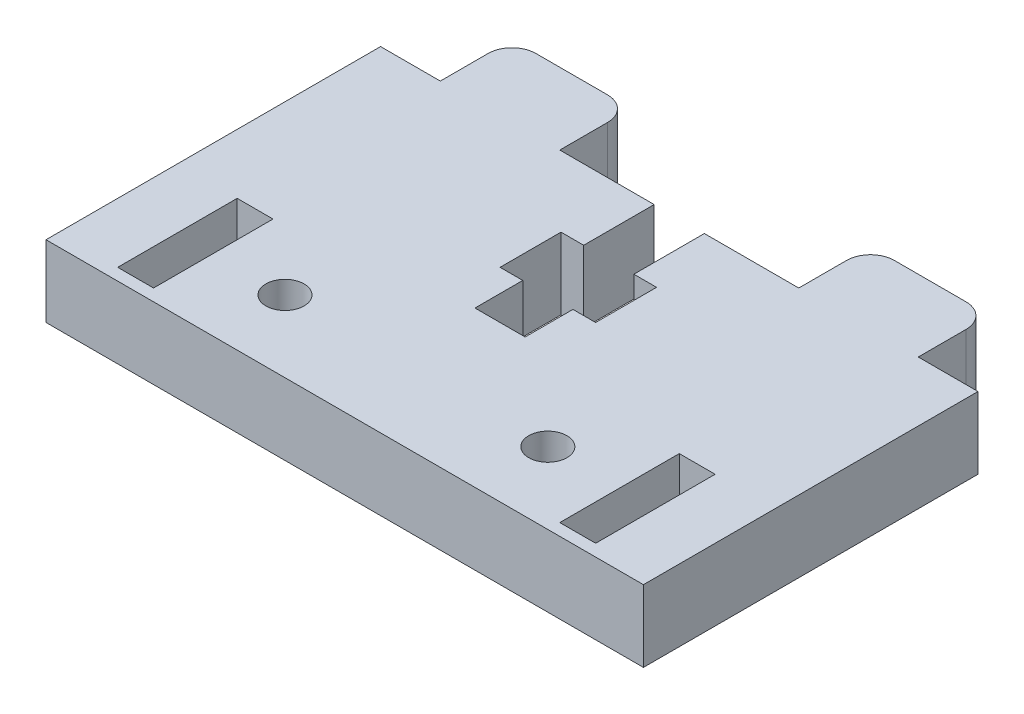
ISO-10303-21;
HEADER;
FILE_DESCRIPTION(('STEP AP214'),'2;1');
FILE_NAME('part.step','',(''),(''),'','','');
FILE_SCHEMA(('AUTOMOTIVE_DESIGN { 1 0 10303 214 1 1 1 1 }'));
ENDSEC;
DATA;
#1=APPLICATION_CONTEXT('core data for automotive mechanical design processes');
#2=APPLICATION_PROTOCOL_DEFINITION('international standard','automotive_design',2000,#1);
#3=PRODUCT_CONTEXT('',#1,'mechanical');
#4=PRODUCT('Part','Part','',(#3));
#5=PRODUCT_RELATED_PRODUCT_CATEGORY('part','',(#4));
#6=PRODUCT_DEFINITION_FORMATION('','',#4);
#7=PRODUCT_DEFINITION_CONTEXT('part definition',#1,'design');
#8=PRODUCT_DEFINITION('design','',#6,#7);
#9=PRODUCT_DEFINITION_SHAPE('','',#8);
#10=(LENGTH_UNIT() NAMED_UNIT(*) SI_UNIT(.MILLI.,.METRE.));
#11=(NAMED_UNIT(*) PLANE_ANGLE_UNIT() SI_UNIT($,.RADIAN.));
#12=(NAMED_UNIT(*) SI_UNIT($,.STERADIAN.) SOLID_ANGLE_UNIT());
#13=UNCERTAINTY_MEASURE_WITH_UNIT(LENGTH_MEASURE(1.E-05),#10,'distance_accuracy_value','');
#14=(GEOMETRIC_REPRESENTATION_CONTEXT(3) GLOBAL_UNCERTAINTY_ASSIGNED_CONTEXT((#13)) GLOBAL_UNIT_ASSIGNED_CONTEXT((#10,
#11,#12)) REPRESENTATION_CONTEXT('',''));
#15=CARTESIAN_POINT('',(0.,0.,0.));
#16=DIRECTION('',(0.,0.,1.));
#17=DIRECTION('',(1.,0.,0.));
#18=AXIS2_PLACEMENT_3D('',#15,#16,#17);
#19=CARTESIAN_POINT('',(45.,6.,0.));
#20=DIRECTION('',(1.,0.,0.));
#21=DIRECTION('',(0.,0.,-1.));
#22=AXIS2_PLACEMENT_3D('',#19,#20,#21);
#23=PLANE('',#22);
#24=DIRECTION('',(0.,0.,1.));
#25=VECTOR('',#24,1.);
#26=CARTESIAN_POINT('',(45.,0.,0.));
#27=LINE('',#26,#25);
#28=CARTESIAN_POINT('',(45.,0.,-11.));
#29=VERTEX_POINT('',#28);
#30=CARTESIAN_POINT('',(45.,0.,-1.));
#31=VERTEX_POINT('',#30);
#32=EDGE_CURVE('E333',#29,#31,#27,.T.);
#33=ORIENTED_EDGE('',*,*,#32,.T.);
#34=DIRECTION('',(0.,-1.,0.));
#35=VECTOR('',#34,1.);
#36=CARTESIAN_POINT('',(45.,6.,-1.));
#37=LINE('',#36,#35);
#38=CARTESIAN_POINT('',(45.,6.,-1.));
#39=VERTEX_POINT('',#38);
#40=EDGE_CURVE('E318',#39,#31,#37,.T.);
#41=ORIENTED_EDGE('',*,*,#40,.F.);
#42=DIRECTION('',(0.,0.,1.));
#43=VECTOR('',#42,1.);
#44=CARTESIAN_POINT('',(45.,6.,0.));
#45=LINE('',#44,#43);
#46=CARTESIAN_POINT('',(45.,6.,-11.));
#47=VERTEX_POINT('',#46);
#48=EDGE_CURVE('E413',#47,#39,#45,.T.);
#49=ORIENTED_EDGE('',*,*,#48,.F.);
#50=DIRECTION('',(0.,-1.,0.));
#51=VECTOR('',#50,1.);
#52=CARTESIAN_POINT('',(45.,6.,-11.));
#53=LINE('',#52,#51);
#54=EDGE_CURVE('E235',#47,#29,#53,.T.);
#55=ORIENTED_EDGE('',*,*,#54,.T.);
#56=EDGE_LOOP('',(#33,#41,#49,#55));
#57=FACE_BOUND('',#56,.T.);
#58=ADVANCED_FACE('F121',(#57),#23,.F.);
#59=CARTESIAN_POINT('',(0.,6.,-1.));
#60=DIRECTION('',(0.,0.,-1.));
#61=DIRECTION('',(-1.,0.,0.));
#62=AXIS2_PLACEMENT_3D('',#59,#60,#61);
#63=PLANE('',#62);
#64=DIRECTION('',(1.,0.,0.));
#65=VECTOR('',#64,1.);
#66=CARTESIAN_POINT('',(0.,0.,-1.));
#67=LINE('',#66,#65);
#68=CARTESIAN_POINT('',(42.,0.,-1.));
#69=VERTEX_POINT('',#68);
#70=EDGE_CURVE('E330',#69,#31,#67,.T.);
#71=ORIENTED_EDGE('',*,*,#70,.F.);
#72=DIRECTION('',(0.,-1.,0.));
#73=VECTOR('',#72,1.);
#74=CARTESIAN_POINT('',(42.,6.,-1.));
#75=LINE('',#74,#73);
#76=CARTESIAN_POINT('',(42.,6.,-1.));
#77=VERTEX_POINT('',#76);
#78=EDGE_CURVE('E321',#77,#69,#75,.T.);
#79=ORIENTED_EDGE('',*,*,#78,.F.);
#80=DIRECTION('',(1.,0.,0.));
#81=VECTOR('',#80,1.);
#82=CARTESIAN_POINT('',(0.,6.,-1.));
#83=LINE('',#82,#81);
#84=EDGE_CURVE('E410',#77,#39,#83,.T.);
#85=ORIENTED_EDGE('',*,*,#84,.T.);
#86=ORIENTED_EDGE('',*,*,#40,.T.);
#87=EDGE_LOOP('',(#71,#79,#85,#86));
#88=FACE_BOUND('',#87,.T.);
#89=ADVANCED_FACE('F737',(#88),#63,.T.);
#90=CARTESIAN_POINT('',(42.,6.,0.));
#91=DIRECTION('',(1.,0.,0.));
#92=DIRECTION('',(0.,0.,-1.));
#93=AXIS2_PLACEMENT_3D('',#90,#91,#92);
#94=PLANE('',#93);
#95=DIRECTION('',(0.,0.,1.));
#96=VECTOR('',#95,1.);
#97=CARTESIAN_POINT('',(42.,0.,0.));
#98=LINE('',#97,#96);
#99=CARTESIAN_POINT('',(42.,0.,-11.));
#100=VERTEX_POINT('',#99);
#101=EDGE_CURVE('E326',#100,#69,#98,.T.);
#102=ORIENTED_EDGE('',*,*,#101,.F.);
#103=DIRECTION('',(0.,-1.,0.));
#104=VECTOR('',#103,1.);
#105=CARTESIAN_POINT('',(42.,6.,-11.));
#106=LINE('',#105,#104);
#107=CARTESIAN_POINT('',(42.,6.,-11.));
#108=VERTEX_POINT('',#107);
#109=EDGE_CURVE('E307',#108,#100,#106,.T.);
#110=ORIENTED_EDGE('',*,*,#109,.F.);
#111=DIRECTION('',(0.,0.,1.));
#112=VECTOR('',#111,1.);
#113=CARTESIAN_POINT('',(42.,6.,0.));
#114=LINE('',#113,#112);
#115=EDGE_CURVE('E303',#108,#77,#114,.T.);
#116=ORIENTED_EDGE('',*,*,#115,.T.);
#117=ORIENTED_EDGE('',*,*,#78,.T.);
#118=EDGE_LOOP('',(#102,#110,#116,#117));
#119=FACE_BOUND('',#118,.T.);
#120=ADVANCED_FACE('F743',(#119),#94,.T.);
#121=CARTESIAN_POINT('',(0.,6.,-11.));
#122=DIRECTION('',(0.,0.,-1.));
#123=DIRECTION('',(-1.,0.,0.));
#124=AXIS2_PLACEMENT_3D('',#121,#122,#123);
#125=PLANE('',#124);
#126=DIRECTION('',(1.,0.,0.));
#127=VECTOR('',#126,1.);
#128=CARTESIAN_POINT('',(0.,0.,-11.));
#129=LINE('',#128,#127);
#130=EDGE_CURVE('E336',#100,#29,#129,.T.);
#131=ORIENTED_EDGE('',*,*,#130,.T.);
#132=ORIENTED_EDGE('',*,*,#54,.F.);
#133=DIRECTION('',(1.,0.,0.));
#134=VECTOR('',#133,1.);
#135=CARTESIAN_POINT('',(0.,6.,-11.));
#136=LINE('',#135,#134);
#137=EDGE_CURVE('E416',#108,#47,#136,.T.);
#138=ORIENTED_EDGE('',*,*,#137,.F.);
#139=ORIENTED_EDGE('',*,*,#109,.T.);
#140=EDGE_LOOP('',(#131,#132,#138,#139));
#141=FACE_BOUND('',#140,.T.);
#142=ADVANCED_FACE('F748',(#141),#125,.F.);
#143=CARTESIAN_POINT('',(8.,6.,0.));
#144=DIRECTION('',(1.,0.,0.));
#145=DIRECTION('',(0.,0.,-1.));
#146=AXIS2_PLACEMENT_3D('',#143,#144,#145);
#147=PLANE('',#146);
#148=DIRECTION('',(0.,0.,1.));
#149=VECTOR('',#148,1.);
#150=CARTESIAN_POINT('',(8.,0.,0.));
#151=LINE('',#150,#149);
#152=CARTESIAN_POINT('',(8.,0.,-11.));
#153=VERTEX_POINT('',#152);
#154=CARTESIAN_POINT('',(8.,0.,-1.));
#155=VERTEX_POINT('',#154);
#156=EDGE_CURVE('E345',#153,#155,#151,.T.);
#157=ORIENTED_EDGE('',*,*,#156,.T.);
#158=DIRECTION('',(0.,-1.,0.));
#159=VECTOR('',#158,1.);
#160=CARTESIAN_POINT('',(8.,6.,-1.));
#161=LINE('',#160,#159);
#162=CARTESIAN_POINT('',(8.,6.,-1.));
#163=VERTEX_POINT('',#162);
#164=EDGE_CURVE('E308',#163,#155,#161,.T.);
#165=ORIENTED_EDGE('',*,*,#164,.F.);
#166=DIRECTION('',(0.,0.,1.));
#167=VECTOR('',#166,1.);
#168=CARTESIAN_POINT('',(8.,6.,0.));
#169=LINE('',#168,#167);
#170=CARTESIAN_POINT('',(8.,6.,-11.));
#171=VERTEX_POINT('',#170);
#172=EDGE_CURVE('E425',#171,#163,#169,.T.);
#173=ORIENTED_EDGE('',*,*,#172,.F.);
#174=DIRECTION('',(0.,-1.,0.));
#175=VECTOR('',#174,1.);
#176=CARTESIAN_POINT('',(8.,6.,-11.));
#177=LINE('',#176,#175);
#178=EDGE_CURVE('E304',#171,#153,#177,.T.);
#179=ORIENTED_EDGE('',*,*,#178,.T.);
#180=EDGE_LOOP('',(#157,#165,#173,#179));
#181=FACE_BOUND('',#180,.T.);
#182=ADVANCED_FACE('F751',(#181),#147,.F.);
#183=CARTESIAN_POINT('',(0.,6.,-0.999999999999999));
#184=DIRECTION('',(0.,0.,-1.));
#185=DIRECTION('',(-1.,0.,0.));
#186=AXIS2_PLACEMENT_3D('',#183,#184,#185);
#187=PLANE('',#186);
#188=DIRECTION('',(1.,0.,0.));
#189=VECTOR('',#188,1.);
#190=CARTESIAN_POINT('',(0.,0.,-0.999999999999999));
#191=LINE('',#190,#189);
#192=CARTESIAN_POINT('',(5.,0.,-1.));
#193=VERTEX_POINT('',#192);
#194=EDGE_CURVE('E342',#193,#155,#191,.T.);
#195=ORIENTED_EDGE('',*,*,#194,.F.);
#196=DIRECTION('',(0.,-1.,0.));
#197=VECTOR('',#196,1.);
#198=CARTESIAN_POINT('',(5.,6.,-1.));
#199=LINE('',#198,#197);
#200=CARTESIAN_POINT('',(5.,6.,-1.));
#201=VERTEX_POINT('',#200);
#202=EDGE_CURVE('E311',#201,#193,#199,.T.);
#203=ORIENTED_EDGE('',*,*,#202,.F.);
#204=DIRECTION('',(1.,0.,0.));
#205=VECTOR('',#204,1.);
#206=CARTESIAN_POINT('',(0.,6.,-0.999999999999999));
#207=LINE('',#206,#205);
#208=EDGE_CURVE('E422',#201,#163,#207,.T.);
#209=ORIENTED_EDGE('',*,*,#208,.T.);
#210=ORIENTED_EDGE('',*,*,#164,.T.);
#211=EDGE_LOOP('',(#195,#203,#209,#210));
#212=FACE_BOUND('',#211,.T.);
#213=ADVANCED_FACE('F757',(#212),#187,.T.);
#214=CARTESIAN_POINT('',(5.,6.,0.));
#215=DIRECTION('',(1.,0.,0.));
#216=DIRECTION('',(0.,0.,-1.));
#217=AXIS2_PLACEMENT_3D('',#214,#215,#216);
#218=PLANE('',#217);
#219=DIRECTION('',(0.,0.,1.));
#220=VECTOR('',#219,1.);
#221=CARTESIAN_POINT('',(5.,0.,0.));
#222=LINE('',#221,#220);
#223=CARTESIAN_POINT('',(5.00000000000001,0.,-11.));
#224=VERTEX_POINT('',#223);
#225=EDGE_CURVE('E339',#224,#193,#222,.T.);
#226=ORIENTED_EDGE('',*,*,#225,.F.);
#227=DIRECTION('',(0.,-1.,0.));
#228=VECTOR('',#227,1.);
#229=CARTESIAN_POINT('',(5.00000000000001,6.,-11.));
#230=LINE('',#229,#228);
#231=CARTESIAN_POINT('',(5.00000000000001,6.,-11.));
#232=VERTEX_POINT('',#231);
#233=EDGE_CURVE('E239',#232,#224,#230,.T.);
#234=ORIENTED_EDGE('',*,*,#233,.F.);
#235=DIRECTION('',(0.,0.,1.));
#236=VECTOR('',#235,1.);
#237=CARTESIAN_POINT('',(5.,6.,0.));
#238=LINE('',#237,#236);
#239=EDGE_CURVE('E419',#232,#201,#238,.T.);
#240=ORIENTED_EDGE('',*,*,#239,.T.);
#241=ORIENTED_EDGE('',*,*,#202,.T.);
#242=EDGE_LOOP('',(#226,#234,#240,#241));
#243=FACE_BOUND('',#242,.T.);
#244=ADVANCED_FACE('F753',(#243),#218,.T.);
#245=CARTESIAN_POINT('',(0.,6.,-11.));
#246=DIRECTION('',(0.,0.,-1.));
#247=DIRECTION('',(-1.,0.,0.));
#248=AXIS2_PLACEMENT_3D('',#245,#246,#247);
#249=PLANE('',#248);
#250=DIRECTION('',(1.,0.,0.));
#251=VECTOR('',#250,1.);
#252=CARTESIAN_POINT('',(0.,0.,-11.));
#253=LINE('',#252,#251);
#254=EDGE_CURVE('E348',#224,#153,#253,.T.);
#255=ORIENTED_EDGE('',*,*,#254,.T.);
#256=ORIENTED_EDGE('',*,*,#178,.F.);
#257=DIRECTION('',(1.,0.,0.));
#258=VECTOR('',#257,1.);
#259=CARTESIAN_POINT('',(0.,6.,-11.));
#260=LINE('',#259,#258);
#261=EDGE_CURVE('E428',#232,#171,#260,.T.);
#262=ORIENTED_EDGE('',*,*,#261,.F.);
#263=ORIENTED_EDGE('',*,*,#233,.T.);
#264=EDGE_LOOP('',(#255,#256,#262,#263));
#265=FACE_BOUND('',#264,.T.);
#266=ADVANCED_FACE('F756',(#265),#249,.F.);
#267=CARTESIAN_POINT('',(14.,6.,-6.));
#268=DIRECTION('',(0.,-1.,0.));
#269=DIRECTION('',(0.,0.,-1.));
#270=AXIS2_PLACEMENT_3D('',#267,#268,#269);
#271=CYLINDRICAL_SURFACE('',#270,1.6);
#272=CARTESIAN_POINT('',(14.,6.,-6.));
#273=DIRECTION('',(0.,1.,0.));
#274=DIRECTION('',(0.,0.,1.));
#275=AXIS2_PLACEMENT_3D('',#272,#273,#274);
#276=CIRCLE('',#275,1.6);
#277=CARTESIAN_POINT('',(14.,6.,-4.4));
#278=VERTEX_POINT('',#277);
#279=EDGE_CURVE('E431',#278,#278,#276,.T.);
#280=ORIENTED_EDGE('',*,*,#279,.T.);
#281=EDGE_LOOP('',(#280));
#282=FACE_BOUND('',#281,.T.);
#283=CARTESIAN_POINT('',(14.,0.,-6.));
#284=DIRECTION('',(0.,1.,0.));
#285=DIRECTION('',(0.,0.,1.));
#286=AXIS2_PLACEMENT_3D('',#283,#284,#285);
#287=CIRCLE('',#286,1.6);
#288=CARTESIAN_POINT('',(14.,0.,-4.4));
#289=VERTEX_POINT('',#288);
#290=EDGE_CURVE('E351',#289,#289,#287,.T.);
#291=ORIENTED_EDGE('',*,*,#290,.F.);
#292=EDGE_LOOP('',(#291));
#293=FACE_BOUND('',#292,.T.);
#294=ADVANCED_FACE('F767',(#282,#293),#271,.F.);
#295=CARTESIAN_POINT('',(36.,6.,-6.));
#296=DIRECTION('',(0.,-1.,0.));
#297=DIRECTION('',(0.,0.,-1.));
#298=AXIS2_PLACEMENT_3D('',#295,#296,#297);
#299=CYLINDRICAL_SURFACE('',#298,1.6);
#300=CARTESIAN_POINT('',(36.,6.,-6.));
#301=DIRECTION('',(0.,1.,0.));
#302=DIRECTION('',(0.,0.,1.));
#303=AXIS2_PLACEMENT_3D('',#300,#301,#302);
#304=CIRCLE('',#303,1.6);
#305=CARTESIAN_POINT('',(36.,6.,-4.4));
#306=VERTEX_POINT('',#305);
#307=EDGE_CURVE('E434',#306,#306,#304,.T.);
#308=ORIENTED_EDGE('',*,*,#307,.T.);
#309=EDGE_LOOP('',(#308));
#310=FACE_BOUND('',#309,.T.);
#311=CARTESIAN_POINT('',(36.,0.,-6.));
#312=DIRECTION('',(0.,1.,0.));
#313=DIRECTION('',(0.,0.,1.));
#314=AXIS2_PLACEMENT_3D('',#311,#312,#313);
#315=CIRCLE('',#314,1.6);
#316=CARTESIAN_POINT('',(36.,0.,-4.4));
#317=VERTEX_POINT('',#316);
#318=EDGE_CURVE('E354',#317,#317,#315,.T.);
#319=ORIENTED_EDGE('',*,*,#318,.F.);
#320=EDGE_LOOP('',(#319));
#321=FACE_BOUND('',#320,.T.);
#322=ADVANCED_FACE('F771',(#310,#321),#299,.F.);
#323=CARTESIAN_POINT('',(35.,6.,0.));
#324=DIRECTION('',(-1.,0.,0.));
#325=DIRECTION('',(0.,0.,1.));
#326=AXIS2_PLACEMENT_3D('',#323,#324,#325);
#327=PLANE('',#326);
#328=DIRECTION('',(0.,0.,-1.));
#329=VECTOR('',#328,1.);
#330=CARTESIAN_POINT('',(35.,0.,0.));
#331=LINE('',#330,#329);
#332=CARTESIAN_POINT('',(35.,0.,-28.));
#333=VERTEX_POINT('',#332);
#334=CARTESIAN_POINT('',(35.,0.,-32.));
#335=VERTEX_POINT('',#334);
#336=EDGE_CURVE('E403',#333,#335,#331,.T.);
#337=ORIENTED_EDGE('',*,*,#336,.F.);
#338=DIRECTION('',(0.,-1.,0.));
#339=VECTOR('',#338,1.);
#340=CARTESIAN_POINT('',(35.,6.,-28.));
#341=LINE('',#340,#339);
#342=CARTESIAN_POINT('',(35.,6.,-28.));
#343=VERTEX_POINT('',#342);
#344=EDGE_CURVE('E240',#343,#333,#341,.T.);
#345=ORIENTED_EDGE('',*,*,#344,.F.);
#346=DIRECTION('',(0.,0.,-1.));
#347=VECTOR('',#346,1.);
#348=CARTESIAN_POINT('',(35.,6.,0.));
#349=LINE('',#348,#347);
#350=CARTESIAN_POINT('',(35.,6.,-32.));
#351=VERTEX_POINT('',#350);
#352=EDGE_CURVE('E485',#343,#351,#349,.T.);
#353=ORIENTED_EDGE('',*,*,#352,.T.);
#354=DIRECTION('',(0.,-1.,0.));
#355=VECTOR('',#354,1.);
#356=CARTESIAN_POINT('',(35.,6.,-32.));
#357=LINE('',#356,#355);
#358=EDGE_CURVE('E236',#351,#335,#357,.T.);
#359=ORIENTED_EDGE('',*,*,#358,.T.);
#360=EDGE_LOOP('',(#337,#345,#353,#359));
#361=FACE_BOUND('',#360,.T.);
#362=ADVANCED_FACE('F662',(#361),#327,.T.);
#363=CARTESIAN_POINT('',(0.,6.,-28.));
#364=DIRECTION('',(0.,0.,-1.));
#365=DIRECTION('',(-1.,0.,0.));
#366=AXIS2_PLACEMENT_3D('',#363,#364,#365);
#367=PLANE('',#366);
#368=DIRECTION('',(1.,0.,0.));
#369=VECTOR('',#368,1.);
#370=CARTESIAN_POINT('',(0.,0.,-28.));
#371=LINE('',#370,#369);
#372=CARTESIAN_POINT('',(27.1,0.,-28.));
#373=VERTEX_POINT('',#372);
#374=EDGE_CURVE('E400',#373,#333,#371,.T.);
#375=ORIENTED_EDGE('',*,*,#374,.F.);
#376=DIRECTION('',(0.,-1.,0.));
#377=VECTOR('',#376,1.);
#378=CARTESIAN_POINT('',(27.1,6.,-28.));
#379=LINE('',#378,#377);
#380=CARTESIAN_POINT('',(27.1,6.,-28.));
#381=VERTEX_POINT('',#380);
#382=EDGE_CURVE('E243',#381,#373,#379,.T.);
#383=ORIENTED_EDGE('',*,*,#382,.F.);
#384=DIRECTION('',(1.,0.,0.));
#385=VECTOR('',#384,1.);
#386=CARTESIAN_POINT('',(0.,6.,-28.));
#387=LINE('',#386,#385);
#388=EDGE_CURVE('E482',#381,#343,#387,.T.);
#389=ORIENTED_EDGE('',*,*,#388,.T.);
#390=ORIENTED_EDGE('',*,*,#344,.T.);
#391=EDGE_LOOP('',(#375,#383,#389,#390));
#392=FACE_BOUND('',#391,.T.);
#393=ADVANCED_FACE('F666',(#392),#367,.T.);
#394=CARTESIAN_POINT('',(27.1,6.,0.));
#395=DIRECTION('',(1.,0.,0.));
#396=DIRECTION('',(0.,0.,-1.));
#397=AXIS2_PLACEMENT_3D('',#394,#395,#396);
#398=PLANE('',#397);
#399=DIRECTION('',(0.,0.,1.));
#400=VECTOR('',#399,1.);
#401=CARTESIAN_POINT('',(27.1,0.,0.));
#402=LINE('',#401,#400);
#403=CARTESIAN_POINT('',(27.1,0.,-22.1));
#404=VERTEX_POINT('',#403);
#405=EDGE_CURVE('E397',#373,#404,#402,.T.);
#406=ORIENTED_EDGE('',*,*,#405,.T.);
#407=DIRECTION('',(0.,-1.,0.));
#408=VECTOR('',#407,1.);
#409=CARTESIAN_POINT('',(27.1,6.,-22.1));
#410=LINE('',#409,#408);
#411=CARTESIAN_POINT('',(27.1,6.,-22.1));
#412=VERTEX_POINT('',#411);
#413=EDGE_CURVE('E246',#412,#404,#410,.T.);
#414=ORIENTED_EDGE('',*,*,#413,.F.);
#415=DIRECTION('',(0.,0.,1.));
#416=VECTOR('',#415,1.);
#417=CARTESIAN_POINT('',(27.1,6.,0.));
#418=LINE('',#417,#416);
#419=EDGE_CURVE('E479',#381,#412,#418,.T.);
#420=ORIENTED_EDGE('',*,*,#419,.F.);
#421=ORIENTED_EDGE('',*,*,#382,.T.);
#422=EDGE_LOOP('',(#406,#414,#420,#421));
#423=FACE_BOUND('',#422,.T.);
#424=ADVANCED_FACE('F671',(#423),#398,.F.);
#425=CARTESIAN_POINT('',(0.,6.,-22.1));
#426=DIRECTION('',(0.,0.,-1.));
#427=DIRECTION('',(-1.,0.,0.));
#428=AXIS2_PLACEMENT_3D('',#425,#426,#427);
#429=PLANE('',#428);
#430=DIRECTION('',(1.,0.,0.));
#431=VECTOR('',#430,1.);
#432=CARTESIAN_POINT('',(0.,0.,-22.1));
#433=LINE('',#432,#431);
#434=CARTESIAN_POINT('',(29.,0.,-22.1));
#435=VERTEX_POINT('',#434);
#436=EDGE_CURVE('E394',#404,#435,#433,.T.);
#437=ORIENTED_EDGE('',*,*,#436,.T.);
#438=DIRECTION('',(0.,-1.,0.));
#439=VECTOR('',#438,1.);
#440=CARTESIAN_POINT('',(29.,6.,-22.1));
#441=LINE('',#440,#439);
#442=CARTESIAN_POINT('',(29.,6.,-22.1));
#443=VERTEX_POINT('',#442);
#444=EDGE_CURVE('E249',#443,#435,#441,.T.);
#445=ORIENTED_EDGE('',*,*,#444,.F.);
#446=DIRECTION('',(1.,0.,0.));
#447=VECTOR('',#446,1.);
#448=CARTESIAN_POINT('',(0.,6.,-22.1));
#449=LINE('',#448,#447);
#450=EDGE_CURVE('E476',#412,#443,#449,.T.);
#451=ORIENTED_EDGE('',*,*,#450,.F.);
#452=ORIENTED_EDGE('',*,*,#413,.T.);
#453=EDGE_LOOP('',(#437,#445,#451,#452));
#454=FACE_BOUND('',#453,.T.);
#455=ADVANCED_FACE('F678',(#454),#429,.F.);
#456=CARTESIAN_POINT('',(29.,6.,0.));
#457=DIRECTION('',(1.,0.,0.));
#458=DIRECTION('',(0.,0.,-1.));
#459=AXIS2_PLACEMENT_3D('',#456,#457,#458);
#460=PLANE('',#459);
#461=DIRECTION('',(0.,0.,1.));
#462=VECTOR('',#461,1.);
#463=CARTESIAN_POINT('',(29.,0.,0.));
#464=LINE('',#463,#462);
#465=CARTESIAN_POINT('',(29.,0.,-17.));
#466=VERTEX_POINT('',#465);
#467=EDGE_CURVE('E391',#435,#466,#464,.T.);
#468=ORIENTED_EDGE('',*,*,#467,.T.);
#469=DIRECTION('',(0.,-1.,0.));
#470=VECTOR('',#469,1.);
#471=CARTESIAN_POINT('',(29.,6.,-17.));
#472=LINE('',#471,#470);
#473=CARTESIAN_POINT('',(29.,6.,-17.));
#474=VERTEX_POINT('',#473);
#475=EDGE_CURVE('E252',#474,#466,#472,.T.);
#476=ORIENTED_EDGE('',*,*,#475,.F.);
#477=DIRECTION('',(0.,0.,1.));
#478=VECTOR('',#477,1.);
#479=CARTESIAN_POINT('',(29.,6.,0.));
#480=LINE('',#479,#478);
#481=EDGE_CURVE('E473',#443,#474,#480,.T.);
#482=ORIENTED_EDGE('',*,*,#481,.F.);
#483=ORIENTED_EDGE('',*,*,#444,.T.);
#484=EDGE_LOOP('',(#468,#476,#482,#483));
#485=FACE_BOUND('',#484,.T.);
#486=ADVANCED_FACE('F682',(#485),#460,.F.);
#487=CARTESIAN_POINT('',(0.,6.,-17.));
#488=DIRECTION('',(0.,0.,-1.));
#489=DIRECTION('',(-1.,0.,0.));
#490=AXIS2_PLACEMENT_3D('',#487,#488,#489);
#491=PLANE('',#490);
#492=DIRECTION('',(1.,0.,0.));
#493=VECTOR('',#492,1.);
#494=CARTESIAN_POINT('',(0.,0.,-17.));
#495=LINE('',#494,#493);
#496=CARTESIAN_POINT('',(27.1,0.,-17.));
#497=VERTEX_POINT('',#496);
#498=EDGE_CURVE('E388',#497,#466,#495,.T.);
#499=ORIENTED_EDGE('',*,*,#498,.F.);
#500=DIRECTION('',(0.,-1.,0.));
#501=VECTOR('',#500,1.);
#502=CARTESIAN_POINT('',(27.1,6.,-17.));
#503=LINE('',#502,#501);
#504=CARTESIAN_POINT('',(27.1,6.,-17.));
#505=VERTEX_POINT('',#504);
#506=EDGE_CURVE('E255',#505,#497,#503,.T.);
#507=ORIENTED_EDGE('',*,*,#506,.F.);
#508=DIRECTION('',(1.,0.,0.));
#509=VECTOR('',#508,1.);
#510=CARTESIAN_POINT('',(0.,6.,-17.));
#511=LINE('',#510,#509);
#512=EDGE_CURVE('E470',#505,#474,#511,.T.);
#513=ORIENTED_EDGE('',*,*,#512,.T.);
#514=ORIENTED_EDGE('',*,*,#475,.T.);
#515=EDGE_LOOP('',(#499,#507,#513,#514));
#516=FACE_BOUND('',#515,.T.);
#517=ADVANCED_FACE('F685',(#516),#491,.T.);
#518=CARTESIAN_POINT('',(27.1,0.,-13.));
#519=VERTEX_POINT('',#518);
#520=EDGE_CURVE('E387',#497,#519,#402,.T.);
#521=ORIENTED_EDGE('',*,*,#520,.T.);
#522=DIRECTION('',(0.,-1.,0.));
#523=VECTOR('',#522,1.);
#524=CARTESIAN_POINT('',(27.1,6.,-13.));
#525=LINE('',#524,#523);
#526=CARTESIAN_POINT('',(27.1,6.,-13.));
#527=VERTEX_POINT('',#526);
#528=EDGE_CURVE('E258',#527,#519,#525,.T.);
#529=ORIENTED_EDGE('',*,*,#528,.F.);
#530=EDGE_CURVE('E469',#505,#527,#418,.T.);
#531=ORIENTED_EDGE('',*,*,#530,.F.);
#532=ORIENTED_EDGE('',*,*,#506,.T.);
#533=EDGE_LOOP('',(#521,#529,#531,#532));
#534=FACE_BOUND('',#533,.T.);
#535=ADVANCED_FACE('F692',(#534),#398,.F.);
#536=CARTESIAN_POINT('',(0.,6.,-13.));
#537=DIRECTION('',(0.,0.,-1.));
#538=DIRECTION('',(-1.,0.,0.));
#539=AXIS2_PLACEMENT_3D('',#536,#537,#538);
#540=PLANE('',#539);
#541=DIRECTION('',(1.,0.,0.));
#542=VECTOR('',#541,1.);
#543=CARTESIAN_POINT('',(0.,0.,-13.));
#544=LINE('',#543,#542);
#545=CARTESIAN_POINT('',(22.9,0.,-13.));
#546=VERTEX_POINT('',#545);
#547=EDGE_CURVE('E383',#546,#519,#544,.T.);
#548=ORIENTED_EDGE('',*,*,#547,.F.);
#549=DIRECTION('',(0.,-1.,0.));
#550=VECTOR('',#549,1.);
#551=CARTESIAN_POINT('',(22.9,6.,-13.));
#552=LINE('',#551,#550);
#553=CARTESIAN_POINT('',(22.9,6.,-13.));
#554=VERTEX_POINT('',#553);
#555=EDGE_CURVE('E261',#554,#546,#552,.T.);
#556=ORIENTED_EDGE('',*,*,#555,.F.);
#557=DIRECTION('',(1.,0.,0.));
#558=VECTOR('',#557,1.);
#559=CARTESIAN_POINT('',(0.,6.,-13.));
#560=LINE('',#559,#558);
#561=EDGE_CURVE('E465',#554,#527,#560,.T.);
#562=ORIENTED_EDGE('',*,*,#561,.T.);
#563=ORIENTED_EDGE('',*,*,#528,.T.);
#564=EDGE_LOOP('',(#548,#556,#562,#563));
#565=FACE_BOUND('',#564,.T.);
#566=ADVANCED_FACE('F696',(#565),#540,.T.);
#567=CARTESIAN_POINT('',(22.9,6.,0.));
#568=DIRECTION('',(1.,0.,0.));
#569=DIRECTION('',(0.,0.,-1.));
#570=AXIS2_PLACEMENT_3D('',#567,#568,#569);
#571=PLANE('',#570);
#572=DIRECTION('',(0.,0.,1.));
#573=VECTOR('',#572,1.);
#574=CARTESIAN_POINT('',(22.9,0.,0.));
#575=LINE('',#574,#573);
#576=CARTESIAN_POINT('',(22.9,0.,-17.));
#577=VERTEX_POINT('',#576);
#578=EDGE_CURVE('E380',#577,#546,#575,.T.);
#579=ORIENTED_EDGE('',*,*,#578,.F.);
#580=DIRECTION('',(0.,-1.,0.));
#581=VECTOR('',#580,1.);
#582=CARTESIAN_POINT('',(22.9,6.,-17.));
#583=LINE('',#582,#581);
#584=CARTESIAN_POINT('',(22.9,6.,-17.));
#585=VERTEX_POINT('',#584);
#586=EDGE_CURVE('E264',#585,#577,#583,.T.);
#587=ORIENTED_EDGE('',*,*,#586,.F.);
#588=DIRECTION('',(0.,0.,1.));
#589=VECTOR('',#588,1.);
#590=CARTESIAN_POINT('',(22.9,6.,0.));
#591=LINE('',#590,#589);
#592=EDGE_CURVE('E462',#585,#554,#591,.T.);
#593=ORIENTED_EDGE('',*,*,#592,.T.);
#594=ORIENTED_EDGE('',*,*,#555,.T.);
#595=EDGE_LOOP('',(#579,#587,#593,#594));
#596=FACE_BOUND('',#595,.T.);
#597=ADVANCED_FACE('F699',(#596),#571,.T.);
#598=CARTESIAN_POINT('',(21.,0.,-17.));
#599=VERTEX_POINT('',#598);
#600=EDGE_CURVE('E379',#599,#577,#495,.T.);
#601=ORIENTED_EDGE('',*,*,#600,.F.);
#602=DIRECTION('',(0.,-1.,0.));
#603=VECTOR('',#602,1.);
#604=CARTESIAN_POINT('',(21.,6.,-17.));
#605=LINE('',#604,#603);
#606=CARTESIAN_POINT('',(21.,6.,-17.));
#607=VERTEX_POINT('',#606);
#608=EDGE_CURVE('E267',#607,#599,#605,.T.);
#609=ORIENTED_EDGE('',*,*,#608,.F.);
#610=EDGE_CURVE('E461',#607,#585,#511,.T.);
#611=ORIENTED_EDGE('',*,*,#610,.T.);
#612=ORIENTED_EDGE('',*,*,#586,.T.);
#613=EDGE_LOOP('',(#601,#609,#611,#612));
#614=FACE_BOUND('',#613,.T.);
#615=ADVANCED_FACE('F706',(#614),#491,.T.);
#616=CARTESIAN_POINT('',(21.,6.,0.));
#617=DIRECTION('',(1.,0.,0.));
#618=DIRECTION('',(0.,0.,-1.));
#619=AXIS2_PLACEMENT_3D('',#616,#617,#618);
#620=PLANE('',#619);
#621=DIRECTION('',(0.,0.,1.));
#622=VECTOR('',#621,1.);
#623=CARTESIAN_POINT('',(21.,0.,0.));
#624=LINE('',#623,#622);
#625=CARTESIAN_POINT('',(21.,0.,-22.1));
#626=VERTEX_POINT('',#625);
#627=EDGE_CURVE('E375',#626,#599,#624,.T.);
#628=ORIENTED_EDGE('',*,*,#627,.F.);
#629=DIRECTION('',(0.,-1.,0.));
#630=VECTOR('',#629,1.);
#631=CARTESIAN_POINT('',(21.,6.,-22.1));
#632=LINE('',#631,#630);
#633=CARTESIAN_POINT('',(21.,6.,-22.1));
#634=VERTEX_POINT('',#633);
#635=EDGE_CURVE('E270',#634,#626,#632,.T.);
#636=ORIENTED_EDGE('',*,*,#635,.F.);
#637=DIRECTION('',(0.,0.,1.));
#638=VECTOR('',#637,1.);
#639=CARTESIAN_POINT('',(21.,6.,0.));
#640=LINE('',#639,#638);
#641=EDGE_CURVE('E457',#634,#607,#640,.T.);
#642=ORIENTED_EDGE('',*,*,#641,.T.);
#643=ORIENTED_EDGE('',*,*,#608,.T.);
#644=EDGE_LOOP('',(#628,#636,#642,#643));
#645=FACE_BOUND('',#644,.T.);
#646=ADVANCED_FACE('F709',(#645),#620,.T.);
#647=CARTESIAN_POINT('',(22.9,0.,-22.1));
#648=VERTEX_POINT('',#647);
#649=EDGE_CURVE('E378',#626,#648,#433,.T.);
#650=ORIENTED_EDGE('',*,*,#649,.T.);
#651=DIRECTION('',(0.,-1.,0.));
#652=VECTOR('',#651,1.);
#653=CARTESIAN_POINT('',(22.9,6.,-22.1));
#654=LINE('',#653,#652);
#655=CARTESIAN_POINT('',(22.9,6.,-22.1));
#656=VERTEX_POINT('',#655);
#657=EDGE_CURVE('E273',#656,#648,#654,.T.);
#658=ORIENTED_EDGE('',*,*,#657,.F.);
#659=EDGE_CURVE('E460',#634,#656,#449,.T.);
#660=ORIENTED_EDGE('',*,*,#659,.F.);
#661=ORIENTED_EDGE('',*,*,#635,.T.);
#662=EDGE_LOOP('',(#650,#658,#660,#661));
#663=FACE_BOUND('',#662,.T.);
#664=ADVANCED_FACE('F714',(#663),#429,.F.);
#665=CARTESIAN_POINT('',(22.9,0.,-28.));
#666=VERTEX_POINT('',#665);
#667=EDGE_CURVE('E384',#666,#648,#575,.T.);
#668=ORIENTED_EDGE('',*,*,#667,.F.);
#669=DIRECTION('',(0.,-1.,0.));
#670=VECTOR('',#669,1.);
#671=CARTESIAN_POINT('',(22.9,6.,-28.));
#672=LINE('',#671,#670);
#673=CARTESIAN_POINT('',(22.9,6.,-28.));
#674=VERTEX_POINT('',#673);
#675=EDGE_CURVE('E276',#674,#666,#672,.T.);
#676=ORIENTED_EDGE('',*,*,#675,.F.);
#677=EDGE_CURVE('E466',#674,#656,#591,.T.);
#678=ORIENTED_EDGE('',*,*,#677,.T.);
#679=ORIENTED_EDGE('',*,*,#657,.T.);
#680=EDGE_LOOP('',(#668,#676,#678,#679));
#681=FACE_BOUND('',#680,.T.);
#682=ADVANCED_FACE('F719',(#681),#571,.T.);
#683=CARTESIAN_POINT('',(15.,0.,-28.));
#684=VERTEX_POINT('',#683);
#685=EDGE_CURVE('E404',#684,#666,#371,.T.);
#686=ORIENTED_EDGE('',*,*,#685,.F.);
#687=DIRECTION('',(0.,1.,0.));
#688=VECTOR('',#687,1.);
#689=CARTESIAN_POINT('',(15.,6.,-28.));
#690=LINE('',#689,#688);
#691=CARTESIAN_POINT('',(15.,6.,-28.));
#692=VERTEX_POINT('',#691);
#693=EDGE_CURVE('E131',#684,#692,#690,.T.);
#694=ORIENTED_EDGE('',*,*,#693,.T.);
#695=EDGE_CURVE('E486',#692,#674,#387,.T.);
#696=ORIENTED_EDGE('',*,*,#695,.T.);
#697=ORIENTED_EDGE('',*,*,#675,.T.);
#698=EDGE_LOOP('',(#686,#694,#696,#697));
#699=FACE_BOUND('',#698,.T.);
#700=ADVANCED_FACE('F720',(#699),#367,.T.);
#701=DIRECTION('',(0.,1.,0.));
#702=VECTOR('',#701,1.);
#703=CARTESIAN_POINT('',(5.,6.,-28.));
#704=LINE('',#703,#702);
#705=CARTESIAN_POINT('',(5.,0.,-28.));
#706=VERTEX_POINT('',#705);
#707=CARTESIAN_POINT('',(5.,6.,-28.));
#708=VERTEX_POINT('',#707);
#709=EDGE_CURVE('E12',#706,#708,#704,.T.);
#710=ORIENTED_EDGE('',*,*,#709,.F.);
#711=CARTESIAN_POINT('',(0.,0.,-28.));
#712=VERTEX_POINT('',#711);
#713=EDGE_CURVE('E201',#712,#706,#371,.T.);
#714=ORIENTED_EDGE('',*,*,#713,.F.);
#715=DIRECTION('',(0.,-1.,0.));
#716=VECTOR('',#715,1.);
#717=CARTESIAN_POINT('',(0.,6.,-28.));
#718=LINE('',#717,#716);
#719=CARTESIAN_POINT('',(0.,6.,-28.));
#720=VERTEX_POINT('',#719);
#721=EDGE_CURVE('E279',#720,#712,#718,.T.);
#722=ORIENTED_EDGE('',*,*,#721,.F.);
#723=EDGE_CURVE('E456',#720,#708,#387,.T.);
#724=ORIENTED_EDGE('',*,*,#723,.T.);
#725=EDGE_LOOP('',(#710,#714,#722,#724));
#726=FACE_BOUND('',#725,.T.);
#727=ADVANCED_FACE('F837',(#726),#367,.T.);
#728=CARTESIAN_POINT('',(0.,6.,0.));
#729=DIRECTION('',(-1.,0.,0.));
#730=DIRECTION('',(0.,0.,1.));
#731=AXIS2_PLACEMENT_3D('',#728,#729,#730);
#732=PLANE('',#731);
#733=DIRECTION('',(0.,0.,-1.));
#734=VECTOR('',#733,1.);
#735=CARTESIAN_POINT('',(0.,0.,0.));
#736=LINE('',#735,#734);
#737=CARTESIAN_POINT('',(0.,0.,0.));
#738=VERTEX_POINT('',#737);
#739=EDGE_CURVE('E373',#738,#712,#736,.T.);
#740=ORIENTED_EDGE('',*,*,#739,.F.);
#741=DIRECTION('',(0.,-1.,0.));
#742=VECTOR('',#741,1.);
#743=CARTESIAN_POINT('',(0.,6.,0.));
#744=LINE('',#743,#742);
#745=CARTESIAN_POINT('',(0.,6.,0.));
#746=VERTEX_POINT('',#745);
#747=EDGE_CURVE('E282',#746,#738,#744,.T.);
#748=ORIENTED_EDGE('',*,*,#747,.F.);
#749=DIRECTION('',(0.,0.,-1.));
#750=VECTOR('',#749,1.);
#751=CARTESIAN_POINT('',(0.,6.,0.));
#752=LINE('',#751,#750);
#753=EDGE_CURVE('E453',#746,#720,#752,.T.);
#754=ORIENTED_EDGE('',*,*,#753,.T.);
#755=ORIENTED_EDGE('',*,*,#721,.T.);
#756=EDGE_LOOP('',(#740,#748,#754,#755));
#757=FACE_BOUND('',#756,.T.);
#758=ADVANCED_FACE('F833',(#757),#732,.T.);
#759=CARTESIAN_POINT('',(0.,6.,0.));
#760=DIRECTION('',(0.,0.,-1.));
#761=DIRECTION('',(-1.,0.,0.));
#762=AXIS2_PLACEMENT_3D('',#759,#760,#761);
#763=PLANE('',#762);
#764=DIRECTION('',(1.,0.,0.));
#765=VECTOR('',#764,1.);
#766=CARTESIAN_POINT('',(0.,0.,0.));
#767=LINE('',#766,#765);
#768=CARTESIAN_POINT('',(50.,0.,0.));
#769=VERTEX_POINT('',#768);
#770=EDGE_CURVE('E370',#738,#769,#767,.T.);
#771=ORIENTED_EDGE('',*,*,#770,.T.);
#772=DIRECTION('',(0.,-1.,0.));
#773=VECTOR('',#772,1.);
#774=CARTESIAN_POINT('',(50.,6.,0.));
#775=LINE('',#774,#773);
#776=CARTESIAN_POINT('',(50.,6.,0.));
#777=VERTEX_POINT('',#776);
#778=EDGE_CURVE('E285',#777,#769,#775,.T.);
#779=ORIENTED_EDGE('',*,*,#778,.F.);
#780=DIRECTION('',(1.,0.,0.));
#781=VECTOR('',#780,1.);
#782=CARTESIAN_POINT('',(0.,6.,0.));
#783=LINE('',#782,#781);
#784=EDGE_CURVE('E450',#746,#777,#783,.T.);
#785=ORIENTED_EDGE('',*,*,#784,.F.);
#786=ORIENTED_EDGE('',*,*,#747,.T.);
#787=EDGE_LOOP('',(#771,#779,#785,#786));
#788=FACE_BOUND('',#787,.T.);
#789=ADVANCED_FACE('F836',(#788),#763,.F.);
#790=CARTESIAN_POINT('',(50.,6.,0.));
#791=DIRECTION('',(-1.,0.,0.));
#792=DIRECTION('',(0.,0.,1.));
#793=AXIS2_PLACEMENT_3D('',#790,#791,#792);
#794=PLANE('',#793);
#795=DIRECTION('',(0.,0.,-1.));
#796=VECTOR('',#795,1.);
#797=CARTESIAN_POINT('',(50.,0.,0.));
#798=LINE('',#797,#796);
#799=CARTESIAN_POINT('',(50.,0.,-28.));
#800=VERTEX_POINT('',#799);
#801=EDGE_CURVE('E367',#769,#800,#798,.T.);
#802=ORIENTED_EDGE('',*,*,#801,.T.);
#803=DIRECTION('',(0.,-1.,0.));
#804=VECTOR('',#803,1.);
#805=CARTESIAN_POINT('',(50.,6.,-28.));
#806=LINE('',#805,#804);
#807=CARTESIAN_POINT('',(50.,6.,-28.));
#808=VERTEX_POINT('',#807);
#809=EDGE_CURVE('E288',#808,#800,#806,.T.);
#810=ORIENTED_EDGE('',*,*,#809,.F.);
#811=DIRECTION('',(0.,0.,-1.));
#812=VECTOR('',#811,1.);
#813=CARTESIAN_POINT('',(50.,6.,0.));
#814=LINE('',#813,#812);
#815=EDGE_CURVE('E447',#777,#808,#814,.T.);
#816=ORIENTED_EDGE('',*,*,#815,.F.);
#817=ORIENTED_EDGE('',*,*,#778,.T.);
#818=EDGE_LOOP('',(#802,#810,#816,#817));
#819=FACE_BOUND('',#818,.T.);
#820=ADVANCED_FACE('F841',(#819),#794,.F.);
#821=CARTESIAN_POINT('',(45.,0.,-28.));
#822=VERTEX_POINT('',#821);
#823=EDGE_CURVE('E366',#822,#800,#371,.T.);
#824=ORIENTED_EDGE('',*,*,#823,.F.);
#825=DIRECTION('',(0.,-1.,0.));
#826=VECTOR('',#825,1.);
#827=CARTESIAN_POINT('',(45.,6.,-28.));
#828=LINE('',#827,#826);
#829=CARTESIAN_POINT('',(45.,6.,-28.));
#830=VERTEX_POINT('',#829);
#831=EDGE_CURVE('E291',#830,#822,#828,.T.);
#832=ORIENTED_EDGE('',*,*,#831,.F.);
#833=EDGE_CURVE('E446',#830,#808,#387,.T.);
#834=ORIENTED_EDGE('',*,*,#833,.T.);
#835=ORIENTED_EDGE('',*,*,#809,.T.);
#836=EDGE_LOOP('',(#824,#832,#834,#835));
#837=FACE_BOUND('',#836,.T.);
#838=ADVANCED_FACE('F612',(#837),#367,.T.);
#839=CARTESIAN_POINT('',(45.,6.,0.));
#840=DIRECTION('',(-1.,0.,0.));
#841=DIRECTION('',(0.,0.,1.));
#842=AXIS2_PLACEMENT_3D('',#839,#840,#841);
#843=PLANE('',#842);
#844=DIRECTION('',(0.,0.,-1.));
#845=VECTOR('',#844,1.);
#846=CARTESIAN_POINT('',(45.,0.,0.));
#847=LINE('',#846,#845);
#848=CARTESIAN_POINT('',(45.,0.,-32.));
#849=VERTEX_POINT('',#848);
#850=EDGE_CURVE('E363',#822,#849,#847,.T.);
#851=ORIENTED_EDGE('',*,*,#850,.T.);
#852=DIRECTION('',(0.,-1.,0.));
#853=VECTOR('',#852,1.);
#854=CARTESIAN_POINT('',(45.,6.,-32.));
#855=LINE('',#854,#853);
#856=CARTESIAN_POINT('',(45.,6.,-32.));
#857=VERTEX_POINT('',#856);
#858=EDGE_CURVE('E294',#857,#849,#855,.T.);
#859=ORIENTED_EDGE('',*,*,#858,.F.);
#860=DIRECTION('',(0.,0.,-1.));
#861=VECTOR('',#860,1.);
#862=CARTESIAN_POINT('',(45.,6.,0.));
#863=LINE('',#862,#861);
#864=EDGE_CURVE('E443',#830,#857,#863,.T.);
#865=ORIENTED_EDGE('',*,*,#864,.F.);
#866=ORIENTED_EDGE('',*,*,#831,.T.);
#867=EDGE_LOOP('',(#851,#859,#865,#866));
#868=FACE_BOUND('',#867,.T.);
#869=ADVANCED_FACE('F726',(#868),#843,.F.);
#870=CARTESIAN_POINT('',(43.,6.,-32.));
#871=DIRECTION('',(0.,-1.,0.));
#872=DIRECTION('',(0.,0.,-1.));
#873=AXIS2_PLACEMENT_3D('',#870,#871,#872);
#874=CYLINDRICAL_SURFACE('',#873,2.);
#875=CARTESIAN_POINT('',(43.,0.,-32.));
#876=DIRECTION('',(0.,1.,0.));
#877=DIRECTION('',(0.,0.,1.));
#878=AXIS2_PLACEMENT_3D('',#875,#876,#877);
#879=CIRCLE('',#878,2.);
#880=CARTESIAN_POINT('',(43.,0.,-34.));
#881=VERTEX_POINT('',#880);
#882=EDGE_CURVE('E360',#881,#849,#879,.F.);
#883=ORIENTED_EDGE('',*,*,#882,.F.);
#884=DIRECTION('',(0.,-1.,0.));
#885=VECTOR('',#884,1.);
#886=CARTESIAN_POINT('',(43.,6.,-34.));
#887=LINE('',#886,#885);
#888=CARTESIAN_POINT('',(43.,6.,-34.));
#889=VERTEX_POINT('',#888);
#890=EDGE_CURVE('E297',#889,#881,#887,.T.);
#891=ORIENTED_EDGE('',*,*,#890,.F.);
#892=CARTESIAN_POINT('',(43.,6.,-32.));
#893=DIRECTION('',(0.,1.,0.));
#894=DIRECTION('',(0.,0.,1.));
#895=AXIS2_PLACEMENT_3D('',#892,#893,#894);
#896=CIRCLE('',#895,2.);
#897=EDGE_CURVE('E440',#889,#857,#896,.F.);
#898=ORIENTED_EDGE('',*,*,#897,.T.);
#899=ORIENTED_EDGE('',*,*,#858,.T.);
#900=EDGE_LOOP('',(#883,#891,#898,#899));
#901=FACE_BOUND('',#900,.T.);
#902=ADVANCED_FACE('F727',(#901),#874,.T.);
#903=CARTESIAN_POINT('',(0.,6.,-34.));
#904=DIRECTION('',(0.,0.,-1.));
#905=DIRECTION('',(-1.,0.,0.));
#906=AXIS2_PLACEMENT_3D('',#903,#904,#905);
#907=PLANE('',#906);
#908=DIRECTION('',(1.,0.,0.));
#909=VECTOR('',#908,1.);
#910=CARTESIAN_POINT('',(0.,0.,-34.));
#911=LINE('',#910,#909);
#912=CARTESIAN_POINT('',(37.,0.,-34.));
#913=VERTEX_POINT('',#912);
#914=EDGE_CURVE('E357',#913,#881,#911,.T.);
#915=ORIENTED_EDGE('',*,*,#914,.F.);
#916=DIRECTION('',(0.,-1.,0.));
#917=VECTOR('',#916,1.);
#918=CARTESIAN_POINT('',(37.,6.,-34.));
#919=LINE('',#918,#917);
#920=CARTESIAN_POINT('',(37.,6.,-34.));
#921=VERTEX_POINT('',#920);
#922=EDGE_CURVE('E300',#921,#913,#919,.T.);
#923=ORIENTED_EDGE('',*,*,#922,.F.);
#924=DIRECTION('',(1.,0.,0.));
#925=VECTOR('',#924,1.);
#926=CARTESIAN_POINT('',(0.,6.,-34.));
#927=LINE('',#926,#925);
#928=EDGE_CURVE('E437',#921,#889,#927,.T.);
#929=ORIENTED_EDGE('',*,*,#928,.T.);
#930=ORIENTED_EDGE('',*,*,#890,.T.);
#931=EDGE_LOOP('',(#915,#923,#929,#930));
#932=FACE_BOUND('',#931,.T.);
#933=ADVANCED_FACE('F506',(#932),#907,.T.);
#934=CARTESIAN_POINT('',(37.,6.,-32.));
#935=DIRECTION('',(0.,-1.,0.));
#936=DIRECTION('',(0.,0.,-1.));
#937=AXIS2_PLACEMENT_3D('',#934,#935,#936);
#938=CYLINDRICAL_SURFACE('',#937,2.);
#939=CARTESIAN_POINT('',(37.,0.,-32.));
#940=DIRECTION('',(0.,1.,0.));
#941=DIRECTION('',(0.,0.,1.));
#942=AXIS2_PLACEMENT_3D('',#939,#940,#941);
#943=CIRCLE('',#942,2.);
#944=EDGE_CURVE('E187',#335,#913,#943,.F.);
#945=ORIENTED_EDGE('',*,*,#944,.F.);
#946=ORIENTED_EDGE('',*,*,#358,.F.);
#947=CARTESIAN_POINT('',(37.,6.,-32.));
#948=DIRECTION('',(0.,1.,0.));
#949=DIRECTION('',(0.,0.,1.));
#950=AXIS2_PLACEMENT_3D('',#947,#948,#949);
#951=CIRCLE('',#950,2.);
#952=EDGE_CURVE('E329',#351,#921,#951,.F.);
#953=ORIENTED_EDGE('',*,*,#952,.T.);
#954=ORIENTED_EDGE('',*,*,#922,.T.);
#955=EDGE_LOOP('',(#945,#946,#953,#954));
#956=FACE_BOUND('',#955,.T.);
#957=ADVANCED_FACE('F495',(#956),#938,.T.);
#958=CARTESIAN_POINT('',(0.,0.,0.));
#959=DIRECTION('',(0.,1.,0.));
#960=DIRECTION('',(0.,0.,1.));
#961=AXIS2_PLACEMENT_3D('',#958,#959,#960);
#962=PLANE('',#961);
#963=ORIENTED_EDGE('',*,*,#944,.T.);
#964=ORIENTED_EDGE('',*,*,#914,.T.);
#965=ORIENTED_EDGE('',*,*,#882,.T.);
#966=ORIENTED_EDGE('',*,*,#850,.F.);
#967=ORIENTED_EDGE('',*,*,#823,.T.);
#968=ORIENTED_EDGE('',*,*,#801,.F.);
#969=ORIENTED_EDGE('',*,*,#770,.F.);
#970=ORIENTED_EDGE('',*,*,#739,.T.);
#971=ORIENTED_EDGE('',*,*,#713,.T.);
#972=DIRECTION('',(0.,0.,-1.));
#973=VECTOR('',#972,1.);
#974=CARTESIAN_POINT('',(5.,0.,-28.));
#975=LINE('',#974,#973);
#976=CARTESIAN_POINT('',(5.,0.,-32.));
#977=VERTEX_POINT('',#976);
#978=EDGE_CURVE('E180',#706,#977,#975,.T.);
#979=ORIENTED_EDGE('',*,*,#978,.T.);
#980=CARTESIAN_POINT('',(7.,0.,-32.));
#981=DIRECTION('',(0.,-1.,0.));
#982=DIRECTION('',(0.,0.,-1.));
#983=AXIS2_PLACEMENT_3D('',#980,#981,#982);
#984=CIRCLE('',#983,2.);
#985=CARTESIAN_POINT('',(7.00000000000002,0.,-34.));
#986=VERTEX_POINT('',#985);
#987=EDGE_CURVE('E190',#977,#986,#984,.T.);
#988=ORIENTED_EDGE('',*,*,#987,.T.);
#989=DIRECTION('',(1.,0.,0.));
#990=VECTOR('',#989,1.);
#991=CARTESIAN_POINT('',(7.00000000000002,0.,-34.));
#992=LINE('',#991,#990);
#993=CARTESIAN_POINT('',(13.,0.,-34.));
#994=VERTEX_POINT('',#993);
#995=EDGE_CURVE('E194',#986,#994,#992,.T.);
#996=ORIENTED_EDGE('',*,*,#995,.T.);
#997=CARTESIAN_POINT('',(13.,0.,-32.));
#998=DIRECTION('',(0.,-1.,0.));
#999=DIRECTION('',(0.,0.,-1.));
#1000=AXIS2_PLACEMENT_3D('',#997,#998,#999);
#1001=CIRCLE('',#1000,2.);
#1002=CARTESIAN_POINT('',(15.,0.,-32.));
#1003=VERTEX_POINT('',#1002);
#1004=EDGE_CURVE('E207',#994,#1003,#1001,.T.);
#1005=ORIENTED_EDGE('',*,*,#1004,.T.);
#1006=DIRECTION('',(0.,0.,-1.));
#1007=VECTOR('',#1006,1.);
#1008=CARTESIAN_POINT('',(15.,0.,-28.));
#1009=LINE('',#1008,#1007);
#1010=EDGE_CURVE('E203',#684,#1003,#1009,.T.);
#1011=ORIENTED_EDGE('',*,*,#1010,.F.);
#1012=ORIENTED_EDGE('',*,*,#685,.T.);
#1013=ORIENTED_EDGE('',*,*,#667,.T.);
#1014=ORIENTED_EDGE('',*,*,#649,.F.);
#1015=ORIENTED_EDGE('',*,*,#627,.T.);
#1016=ORIENTED_EDGE('',*,*,#600,.T.);
#1017=ORIENTED_EDGE('',*,*,#578,.T.);
#1018=ORIENTED_EDGE('',*,*,#547,.T.);
#1019=ORIENTED_EDGE('',*,*,#520,.F.);
#1020=ORIENTED_EDGE('',*,*,#498,.T.);
#1021=ORIENTED_EDGE('',*,*,#467,.F.);
#1022=ORIENTED_EDGE('',*,*,#436,.F.);
#1023=ORIENTED_EDGE('',*,*,#405,.F.);
#1024=ORIENTED_EDGE('',*,*,#374,.T.);
#1025=ORIENTED_EDGE('',*,*,#336,.T.);
#1026=EDGE_LOOP('',(#963,#964,#965,#966,#967,#968,#969,#970,#971,#979,#988,#996,#1005,#1011,
#1012,#1013,#1014,#1015,#1016,#1017,#1018,#1019,#1020,#1021,#1022,#1023,#1024,#1025));
#1027=FACE_BOUND('',#1026,.T.);
#1028=ORIENTED_EDGE('',*,*,#318,.T.);
#1029=EDGE_LOOP('',(#1028));
#1030=FACE_BOUND('',#1029,.T.);
#1031=ORIENTED_EDGE('',*,*,#290,.T.);
#1032=EDGE_LOOP('',(#1031));
#1033=FACE_BOUND('',#1032,.T.);
#1034=ORIENTED_EDGE('',*,*,#254,.F.);
#1035=ORIENTED_EDGE('',*,*,#225,.T.);
#1036=ORIENTED_EDGE('',*,*,#194,.T.);
#1037=ORIENTED_EDGE('',*,*,#156,.F.);
#1038=EDGE_LOOP('',(#1034,#1035,#1036,#1037));
#1039=FACE_BOUND('',#1038,.T.);
#1040=ORIENTED_EDGE('',*,*,#130,.F.);
#1041=ORIENTED_EDGE('',*,*,#101,.T.);
#1042=ORIENTED_EDGE('',*,*,#70,.T.);
#1043=ORIENTED_EDGE('',*,*,#32,.F.);
#1044=EDGE_LOOP('',(#1040,#1041,#1042,#1043));
#1045=FACE_BOUND('',#1044,.T.);
#1046=ADVANCED_FACE('F197',(#1027,#1030,#1033,#1039,#1045),#962,.F.);
#1047=CARTESIAN_POINT('',(0.,6.,0.));
#1048=DIRECTION('',(0.,1.,0.));
#1049=DIRECTION('',(0.,0.,1.));
#1050=AXIS2_PLACEMENT_3D('',#1047,#1048,#1049);
#1051=PLANE('',#1050);
#1052=ORIENTED_EDGE('',*,*,#952,.F.);
#1053=ORIENTED_EDGE('',*,*,#352,.F.);
#1054=ORIENTED_EDGE('',*,*,#388,.F.);
#1055=ORIENTED_EDGE('',*,*,#419,.T.);
#1056=ORIENTED_EDGE('',*,*,#450,.T.);
#1057=ORIENTED_EDGE('',*,*,#481,.T.);
#1058=ORIENTED_EDGE('',*,*,#512,.F.);
#1059=ORIENTED_EDGE('',*,*,#530,.T.);
#1060=ORIENTED_EDGE('',*,*,#561,.F.);
#1061=ORIENTED_EDGE('',*,*,#592,.F.);
#1062=ORIENTED_EDGE('',*,*,#610,.F.);
#1063=ORIENTED_EDGE('',*,*,#641,.F.);
#1064=ORIENTED_EDGE('',*,*,#659,.T.);
#1065=ORIENTED_EDGE('',*,*,#677,.F.);
#1066=ORIENTED_EDGE('',*,*,#695,.F.);
#1067=DIRECTION('',(0.,0.,-1.));
#1068=VECTOR('',#1067,1.);
#1069=CARTESIAN_POINT('',(15.,6.,-28.));
#1070=LINE('',#1069,#1068);
#1071=CARTESIAN_POINT('',(15.,6.,-32.));
#1072=VERTEX_POINT('',#1071);
#1073=EDGE_CURVE('E214',#692,#1072,#1070,.T.);
#1074=ORIENTED_EDGE('',*,*,#1073,.T.);
#1075=CARTESIAN_POINT('',(13.,6.,-32.));
#1076=DIRECTION('',(0.,-1.,0.));
#1077=DIRECTION('',(0.,0.,-1.));
#1078=AXIS2_PLACEMENT_3D('',#1075,#1076,#1077);
#1079=CIRCLE('',#1078,2.);
#1080=CARTESIAN_POINT('',(13.,6.,-34.));
#1081=VERTEX_POINT('',#1080);
#1082=EDGE_CURVE('E216',#1081,#1072,#1079,.T.);
#1083=ORIENTED_EDGE('',*,*,#1082,.F.);
#1084=DIRECTION('',(1.,0.,0.));
#1085=VECTOR('',#1084,1.);
#1086=CARTESIAN_POINT('',(7.00000000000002,6.,-34.));
#1087=LINE('',#1086,#1085);
#1088=CARTESIAN_POINT('',(7.00000000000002,6.,-34.));
#1089=VERTEX_POINT('',#1088);
#1090=EDGE_CURVE('E205',#1089,#1081,#1087,.T.);
#1091=ORIENTED_EDGE('',*,*,#1090,.F.);
#1092=CARTESIAN_POINT('',(7.,6.,-32.));
#1093=DIRECTION('',(0.,-1.,0.));
#1094=DIRECTION('',(0.,0.,-1.));
#1095=AXIS2_PLACEMENT_3D('',#1092,#1093,#1094);
#1096=CIRCLE('',#1095,2.);
#1097=CARTESIAN_POINT('',(5.,6.,-32.));
#1098=VERTEX_POINT('',#1097);
#1099=EDGE_CURVE('E202',#1098,#1089,#1096,.T.);
#1100=ORIENTED_EDGE('',*,*,#1099,.F.);
#1101=DIRECTION('',(0.,0.,-1.));
#1102=VECTOR('',#1101,1.);
#1103=CARTESIAN_POINT('',(5.,6.,-28.));
#1104=LINE('',#1103,#1102);
#1105=EDGE_CURVE('E183',#708,#1098,#1104,.T.);
#1106=ORIENTED_EDGE('',*,*,#1105,.F.);
#1107=ORIENTED_EDGE('',*,*,#723,.F.);
#1108=ORIENTED_EDGE('',*,*,#753,.F.);
#1109=ORIENTED_EDGE('',*,*,#784,.T.);
#1110=ORIENTED_EDGE('',*,*,#815,.T.);
#1111=ORIENTED_EDGE('',*,*,#833,.F.);
#1112=ORIENTED_EDGE('',*,*,#864,.T.);
#1113=ORIENTED_EDGE('',*,*,#897,.F.);
#1114=ORIENTED_EDGE('',*,*,#928,.F.);
#1115=EDGE_LOOP('',(#1052,#1053,#1054,#1055,#1056,#1057,#1058,#1059,#1060,#1061,#1062,#1063,
#1064,#1065,#1066,#1074,#1083,#1091,#1100,#1106,#1107,#1108,#1109,#1110,#1111,#1112,#1113,#1114));
#1116=FACE_BOUND('',#1115,.T.);
#1117=ORIENTED_EDGE('',*,*,#307,.F.);
#1118=EDGE_LOOP('',(#1117));
#1119=FACE_BOUND('',#1118,.T.);
#1120=ORIENTED_EDGE('',*,*,#279,.F.);
#1121=EDGE_LOOP('',(#1120));
#1122=FACE_BOUND('',#1121,.T.);
#1123=ORIENTED_EDGE('',*,*,#261,.T.);
#1124=ORIENTED_EDGE('',*,*,#172,.T.);
#1125=ORIENTED_EDGE('',*,*,#208,.F.);
#1126=ORIENTED_EDGE('',*,*,#239,.F.);
#1127=EDGE_LOOP('',(#1123,#1124,#1125,#1126));
#1128=FACE_BOUND('',#1127,.T.);
#1129=ORIENTED_EDGE('',*,*,#137,.T.);
#1130=ORIENTED_EDGE('',*,*,#48,.T.);
#1131=ORIENTED_EDGE('',*,*,#84,.F.);
#1132=ORIENTED_EDGE('',*,*,#115,.F.);
#1133=EDGE_LOOP('',(#1129,#1130,#1131,#1132));
#1134=FACE_BOUND('',#1133,.T.);
#1135=ADVANCED_FACE('F228',(#1116,#1119,#1122,#1128,#1134),#1051,.T.);
#1136=CARTESIAN_POINT('',(5.,6.,-28.));
#1137=DIRECTION('',(-1.,0.,0.));
#1138=DIRECTION('',(0.,0.,1.));
#1139=AXIS2_PLACEMENT_3D('',#1136,#1137,#1138);
#1140=PLANE('',#1139);
#1141=ORIENTED_EDGE('',*,*,#978,.F.);
#1142=ORIENTED_EDGE('',*,*,#709,.T.);
#1143=ORIENTED_EDGE('',*,*,#1105,.T.);
#1144=DIRECTION('',(0.,-1.,0.));
#1145=VECTOR('',#1144,1.);
#1146=CARTESIAN_POINT('',(5.,6.,-32.));
#1147=LINE('',#1146,#1145);
#1148=EDGE_CURVE('E175',#1098,#977,#1147,.T.);
#1149=ORIENTED_EDGE('',*,*,#1148,.T.);
#1150=EDGE_LOOP('',(#1141,#1142,#1143,#1149));
#1151=FACE_BOUND('',#1150,.T.);
#1152=ADVANCED_FACE('F177',(#1151),#1140,.T.);
#1153=CARTESIAN_POINT('',(15.,6.,-28.));
#1154=DIRECTION('',(-1.,0.,0.));
#1155=DIRECTION('',(0.,0.,1.));
#1156=AXIS2_PLACEMENT_3D('',#1153,#1154,#1155);
#1157=PLANE('',#1156);
#1158=ORIENTED_EDGE('',*,*,#1010,.T.);
#1159=DIRECTION('',(0.,-1.,0.));
#1160=VECTOR('',#1159,1.);
#1161=CARTESIAN_POINT('',(15.,6.,-32.));
#1162=LINE('',#1161,#1160);
#1163=EDGE_CURVE('E169',#1072,#1003,#1162,.T.);
#1164=ORIENTED_EDGE('',*,*,#1163,.F.);
#1165=ORIENTED_EDGE('',*,*,#1073,.F.);
#1166=ORIENTED_EDGE('',*,*,#693,.F.);
#1167=EDGE_LOOP('',(#1158,#1164,#1165,#1166));
#1168=FACE_BOUND('',#1167,.T.);
#1169=ADVANCED_FACE('F599',(#1168),#1157,.F.);
#1170=CARTESIAN_POINT('',(13.,6.,-32.));
#1171=DIRECTION('',(0.,-1.,0.));
#1172=DIRECTION('',(0.,0.,-1.));
#1173=AXIS2_PLACEMENT_3D('',#1170,#1171,#1172);
#1174=CYLINDRICAL_SURFACE('',#1173,2.);
#1175=ORIENTED_EDGE('',*,*,#1004,.F.);
#1176=DIRECTION('',(0.,-1.,0.));
#1177=VECTOR('',#1176,1.);
#1178=CARTESIAN_POINT('',(13.,6.,-34.));
#1179=LINE('',#1178,#1177);
#1180=EDGE_CURVE('E211',#1081,#994,#1179,.T.);
#1181=ORIENTED_EDGE('',*,*,#1180,.F.);
#1182=ORIENTED_EDGE('',*,*,#1082,.T.);
#1183=ORIENTED_EDGE('',*,*,#1163,.T.);
#1184=EDGE_LOOP('',(#1175,#1181,#1182,#1183));
#1185=FACE_BOUND('',#1184,.T.);
#1186=ADVANCED_FACE('F223',(#1185),#1174,.T.);
#1187=CARTESIAN_POINT('',(7.00000000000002,6.,-34.));
#1188=DIRECTION('',(0.,0.,-1.));
#1189=DIRECTION('',(-1.,0.,0.));
#1190=AXIS2_PLACEMENT_3D('',#1187,#1188,#1189);
#1191=PLANE('',#1190);
#1192=ORIENTED_EDGE('',*,*,#995,.F.);
#1193=DIRECTION('',(0.,-1.,0.));
#1194=VECTOR('',#1193,1.);
#1195=CARTESIAN_POINT('',(7.00000000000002,6.,-34.));
#1196=LINE('',#1195,#1194);
#1197=EDGE_CURVE('E125',#1089,#986,#1196,.T.);
#1198=ORIENTED_EDGE('',*,*,#1197,.F.);
#1199=ORIENTED_EDGE('',*,*,#1090,.T.);
#1200=ORIENTED_EDGE('',*,*,#1180,.T.);
#1201=EDGE_LOOP('',(#1192,#1198,#1199,#1200));
#1202=FACE_BOUND('',#1201,.T.);
#1203=ADVANCED_FACE('F231',(#1202),#1191,.T.);
#1204=CARTESIAN_POINT('',(7.,6.,-32.));
#1205=DIRECTION('',(0.,-1.,0.));
#1206=DIRECTION('',(0.,0.,-1.));
#1207=AXIS2_PLACEMENT_3D('',#1204,#1205,#1206);
#1208=CYLINDRICAL_SURFACE('',#1207,2.);
#1209=ORIENTED_EDGE('',*,*,#987,.F.);
#1210=ORIENTED_EDGE('',*,*,#1148,.F.);
#1211=ORIENTED_EDGE('',*,*,#1099,.T.);
#1212=ORIENTED_EDGE('',*,*,#1197,.T.);
#1213=EDGE_LOOP('',(#1209,#1210,#1211,#1212));
#1214=FACE_BOUND('',#1213,.T.);
#1215=ADVANCED_FACE('F123',(#1214),#1208,.T.);
#1216=CLOSED_SHELL('',(#58,#89,#120,#142,#182,#213,#244,#266,#294,#322,#362,#393,#424,#455,#486,
#517,#535,#566,#597,#615,#646,#664,#682,#700,#727,#758,#789,#820,#838,#869,#902,#933,#957,#1046,
#1135,#1152,#1169,#1186,#1203,#1215));
#1217=MANIFOLD_SOLID_BREP('B2',#1216);
#1218=ADVANCED_BREP_SHAPE_REPRESENTATION('',(#18,#1217),#14);
#1219=SHAPE_DEFINITION_REPRESENTATION(#9,#1218);
ENDSEC;
END-ISO-10303-21;
